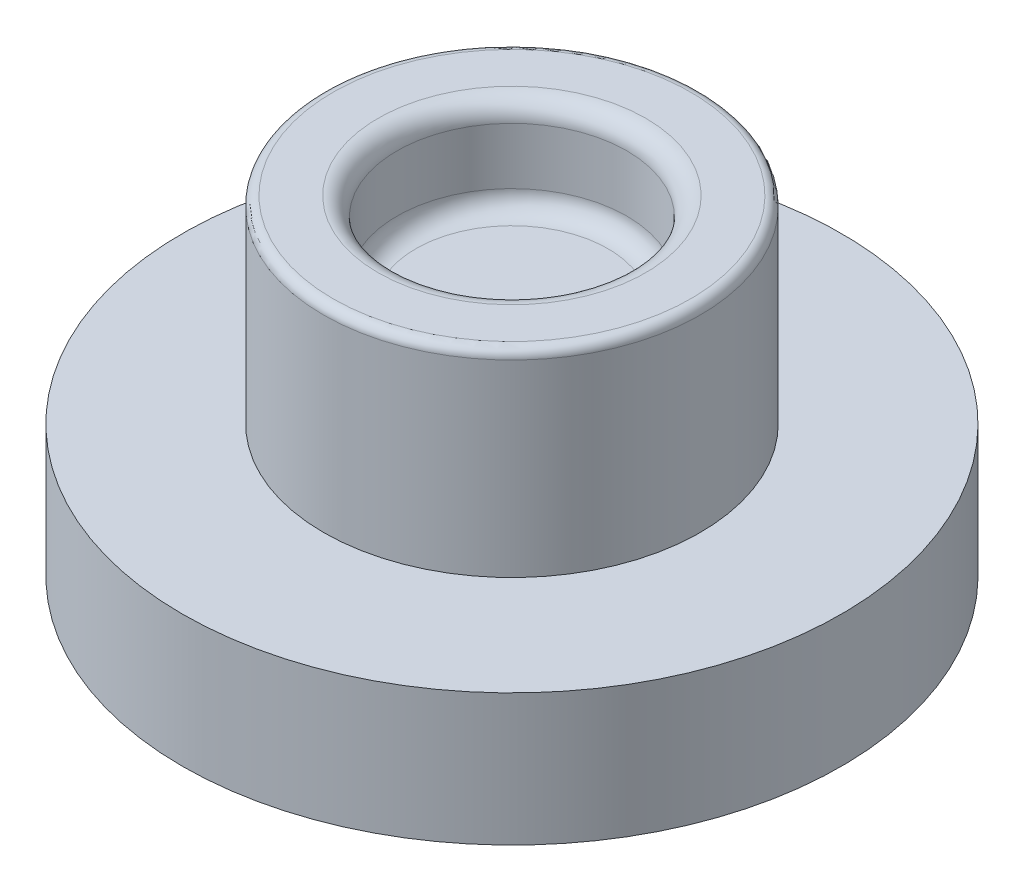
ISO-10303-21;
HEADER;
FILE_DESCRIPTION(('STEP AP214'),'2;1');
FILE_NAME('part.step','',(''),(''),'','','');
FILE_SCHEMA(('AUTOMOTIVE_DESIGN { 1 0 10303 214 1 1 1 1 }'));
ENDSEC;
DATA;
#1=APPLICATION_CONTEXT('core data for automotive mechanical design processes');
#2=APPLICATION_PROTOCOL_DEFINITION('international standard','automotive_design',2000,#1);
#3=PRODUCT_CONTEXT('',#1,'mechanical');
#4=PRODUCT('Part','Part','',(#3));
#5=PRODUCT_RELATED_PRODUCT_CATEGORY('part','',(#4));
#6=PRODUCT_DEFINITION_FORMATION('','',#4);
#7=PRODUCT_DEFINITION_CONTEXT('part definition',#1,'design');
#8=PRODUCT_DEFINITION('design','',#6,#7);
#9=PRODUCT_DEFINITION_SHAPE('','',#8);
#10=(LENGTH_UNIT() NAMED_UNIT(*) SI_UNIT(.MILLI.,.METRE.));
#11=(NAMED_UNIT(*) PLANE_ANGLE_UNIT() SI_UNIT($,.RADIAN.));
#12=(NAMED_UNIT(*) SI_UNIT($,.STERADIAN.) SOLID_ANGLE_UNIT());
#13=UNCERTAINTY_MEASURE_WITH_UNIT(LENGTH_MEASURE(1.E-05),#10,'distance_accuracy_value','');
#14=(GEOMETRIC_REPRESENTATION_CONTEXT(3) GLOBAL_UNCERTAINTY_ASSIGNED_CONTEXT((#13)) GLOBAL_UNIT_ASSIGNED_CONTEXT((#10,
#11,#12)) REPRESENTATION_CONTEXT('',''));
#15=CARTESIAN_POINT('',(0.,0.,0.));
#16=DIRECTION('',(0.,0.,1.));
#17=DIRECTION('',(1.,0.,0.));
#18=AXIS2_PLACEMENT_3D('',#15,#16,#17);
#19=CARTESIAN_POINT('',(0.,-1.4,0.));
#20=DIRECTION('',(0.,1.,0.));
#21=DIRECTION('',(0.,0.,1.));
#22=AXIS2_PLACEMENT_3D('',#19,#20,#21);
#23=CYLINDRICAL_SURFACE('',#22,3.5);
#24=CARTESIAN_POINT('',(0.,-1.4,0.));
#25=DIRECTION('',(0.,1.,0.));
#26=DIRECTION('',(0.,0.,1.));
#27=AXIS2_PLACEMENT_3D('',#24,#25,#26);
#28=CIRCLE('',#27,3.5);
#29=CARTESIAN_POINT('',(0.,-1.4,3.5));
#30=VERTEX_POINT('',#29);
#31=EDGE_CURVE('E62',#30,#30,#28,.T.);
#32=ORIENTED_EDGE('',*,*,#31,.T.);
#33=EDGE_LOOP('',(#32));
#34=FACE_BOUND('',#33,.T.);
#35=CARTESIAN_POINT('',(0.,0.,0.));
#36=DIRECTION('',(0.,1.,0.));
#37=DIRECTION('',(0.,0.,1.));
#38=AXIS2_PLACEMENT_3D('',#35,#36,#37);
#39=CIRCLE('',#38,3.5);
#40=CARTESIAN_POINT('',(0.,0.,3.5));
#41=VERTEX_POINT('',#40);
#42=EDGE_CURVE('E10',#41,#41,#39,.T.);
#43=ORIENTED_EDGE('',*,*,#42,.F.);
#44=EDGE_LOOP('',(#43));
#45=FACE_BOUND('',#44,.T.);
#46=ADVANCED_FACE('F31',(#34,#45),#23,.T.);
#47=CARTESIAN_POINT('',(2.,0.,0.));
#48=DIRECTION('',(0.,1.,0.));
#49=DIRECTION('',(0.,0.,1.));
#50=AXIS2_PLACEMENT_3D('',#47,#48,#49);
#51=PLANE('',#50);
#52=ORIENTED_EDGE('',*,*,#42,.T.);
#53=EDGE_LOOP('',(#52));
#54=FACE_BOUND('',#53,.T.);
#55=CARTESIAN_POINT('',(0.,0.,0.));
#56=DIRECTION('',(0.,1.,0.));
#57=DIRECTION('',(0.,0.,1.));
#58=AXIS2_PLACEMENT_3D('',#55,#56,#57);
#59=CIRCLE('',#58,2.);
#60=CARTESIAN_POINT('',(0.,0.,2.));
#61=VERTEX_POINT('',#60);
#62=EDGE_CURVE('E37',#61,#61,#59,.T.);
#63=ORIENTED_EDGE('',*,*,#62,.F.);
#64=EDGE_LOOP('',(#63));
#65=FACE_BOUND('',#64,.T.);
#66=ADVANCED_FACE('F79',(#54,#65),#51,.T.);
#67=CARTESIAN_POINT('',(0.,-1.4,0.));
#68=DIRECTION('',(0.,1.,0.));
#69=DIRECTION('',(0.,0.,1.));
#70=AXIS2_PLACEMENT_3D('',#67,#68,#69);
#71=CYLINDRICAL_SURFACE('',#70,2.);
#72=ORIENTED_EDGE('',*,*,#62,.T.);
#73=EDGE_LOOP('',(#72));
#74=FACE_BOUND('',#73,.T.);
#75=CARTESIAN_POINT('',(0.,2.,0.));
#76=DIRECTION('',(0.,1.,0.));
#77=DIRECTION('',(0.,0.,1.));
#78=AXIS2_PLACEMENT_3D('',#75,#76,#77);
#79=CIRCLE('',#78,2.);
#80=CARTESIAN_POINT('',(0.,2.,2.));
#81=VERTEX_POINT('',#80);
#82=EDGE_CURVE('E41',#81,#81,#79,.T.);
#83=ORIENTED_EDGE('',*,*,#82,.F.);
#84=EDGE_LOOP('',(#83));
#85=FACE_BOUND('',#84,.T.);
#86=ADVANCED_FACE('F83',(#74,#85),#71,.T.);
#87=CARTESIAN_POINT('',(0.,2.,0.));
#88=DIRECTION('',(0.,1.,0.));
#89=DIRECTION('',(0.,0.,1.));
#90=AXIS2_PLACEMENT_3D('',#87,#88,#89);
#91=TOROIDAL_SURFACE('',#90,1.9,0.1);
#92=ORIENTED_EDGE('',*,*,#82,.T.);
#93=EDGE_LOOP('',(#92));
#94=FACE_BOUND('',#93,.T.);
#95=CARTESIAN_POINT('',(0.,2.1,0.));
#96=DIRECTION('',(0.,1.,0.));
#97=DIRECTION('',(0.,0.,1.));
#98=AXIS2_PLACEMENT_3D('',#95,#96,#97);
#99=CIRCLE('',#98,1.90000000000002);
#100=CARTESIAN_POINT('',(0.,2.1,1.90000000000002));
#101=VERTEX_POINT('',#100);
#102=EDGE_CURVE('E45',#101,#101,#99,.T.);
#103=ORIENTED_EDGE('',*,*,#102,.F.);
#104=EDGE_LOOP('',(#103));
#105=FACE_BOUND('',#104,.T.);
#106=ADVANCED_FACE('F87',(#94,#105),#91,.T.);
#107=CARTESIAN_POINT('',(1.42119739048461,2.1,0.));
#108=DIRECTION('',(0.,1.,0.));
#109=DIRECTION('',(0.,0.,1.));
#110=AXIS2_PLACEMENT_3D('',#107,#108,#109);
#111=PLANE('',#110);
#112=ORIENTED_EDGE('',*,*,#102,.T.);
#113=EDGE_LOOP('',(#112));
#114=FACE_BOUND('',#113,.T.);
#115=CARTESIAN_POINT('',(0.,2.1,0.));
#116=DIRECTION('',(0.,1.,0.));
#117=DIRECTION('',(0.,0.,1.));
#118=AXIS2_PLACEMENT_3D('',#115,#116,#117);
#119=CIRCLE('',#118,1.42119739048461);
#120=CARTESIAN_POINT('',(0.,2.1,1.42119739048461));
#121=VERTEX_POINT('',#120);
#122=EDGE_CURVE('E50',#121,#121,#119,.T.);
#123=ORIENTED_EDGE('',*,*,#122,.F.);
#124=EDGE_LOOP('',(#123));
#125=FACE_BOUND('',#124,.T.);
#126=ADVANCED_FACE('F93',(#114,#125),#111,.T.);
#127=CARTESIAN_POINT('',(0.,1.9,0.));
#128=DIRECTION('',(0.,1.,0.));
#129=DIRECTION('',(0.,0.,1.));
#130=AXIS2_PLACEMENT_3D('',#127,#128,#129);
#131=TOROIDAL_SURFACE('',#130,1.42119739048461,0.2);
#132=ORIENTED_EDGE('',*,*,#122,.T.);
#133=EDGE_LOOP('',(#132));
#134=FACE_BOUND('',#133,.T.);
#135=CARTESIAN_POINT('',(0.,1.9,0.));
#136=DIRECTION('',(0.,1.,0.));
#137=DIRECTION('',(0.,0.,1.));
#138=AXIS2_PLACEMENT_3D('',#135,#136,#137);
#139=CIRCLE('',#138,1.22119739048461);
#140=CARTESIAN_POINT('',(0.,1.9,1.22119739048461));
#141=VERTEX_POINT('',#140);
#142=EDGE_CURVE('E53',#141,#141,#139,.T.);
#143=ORIENTED_EDGE('',*,*,#142,.F.);
#144=EDGE_LOOP('',(#143));
#145=FACE_BOUND('',#144,.T.);
#146=ADVANCED_FACE('F97',(#134,#145),#131,.T.);
#147=CARTESIAN_POINT('',(0.,-1.4,0.));
#148=DIRECTION('',(0.,1.,0.));
#149=DIRECTION('',(0.,0.,1.));
#150=AXIS2_PLACEMENT_3D('',#147,#148,#149);
#151=CYLINDRICAL_SURFACE('',#150,1.22119739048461);
#152=ORIENTED_EDGE('',*,*,#142,.T.);
#153=EDGE_LOOP('',(#152));
#154=FACE_BOUND('',#153,.T.);
#155=CARTESIAN_POINT('',(0.,1.3,0.));
#156=DIRECTION('',(0.,1.,0.));
#157=DIRECTION('',(0.,0.,1.));
#158=AXIS2_PLACEMENT_3D('',#155,#156,#157);
#159=CIRCLE('',#158,1.22119739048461);
#160=CARTESIAN_POINT('',(0.,1.3,1.22119739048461));
#161=VERTEX_POINT('',#160);
#162=EDGE_CURVE('E56',#161,#161,#159,.T.);
#163=ORIENTED_EDGE('',*,*,#162,.F.);
#164=EDGE_LOOP('',(#163));
#165=FACE_BOUND('',#164,.T.);
#166=ADVANCED_FACE('F101',(#154,#165),#151,.F.);
#167=CARTESIAN_POINT('',(0.,1.3,0.));
#168=DIRECTION('',(0.,1.,0.));
#169=DIRECTION('',(0.,0.,1.));
#170=AXIS2_PLACEMENT_3D('',#167,#168,#169);
#171=TOROIDAL_SURFACE('',#170,1.02119739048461,0.2);
#172=ORIENTED_EDGE('',*,*,#162,.T.);
#173=EDGE_LOOP('',(#172));
#174=FACE_BOUND('',#173,.T.);
#175=CARTESIAN_POINT('',(0.,1.1,0.));
#176=DIRECTION('',(0.,1.,0.));
#177=DIRECTION('',(0.,0.,1.));
#178=AXIS2_PLACEMENT_3D('',#175,#176,#177);
#179=CIRCLE('',#178,1.02119739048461);
#180=CARTESIAN_POINT('',(0.,1.1,1.02119739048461));
#181=VERTEX_POINT('',#180);
#182=EDGE_CURVE('E59',#181,#181,#179,.T.);
#183=ORIENTED_EDGE('',*,*,#182,.F.);
#184=EDGE_LOOP('',(#183));
#185=FACE_BOUND('',#184,.T.);
#186=ADVANCED_FACE('F75',(#174,#185),#171,.F.);
#187=CARTESIAN_POINT('',(0.,1.1,0.));
#188=DIRECTION('',(0.,1.,0.));
#189=DIRECTION('',(0.,0.,1.));
#190=AXIS2_PLACEMENT_3D('',#187,#188,#189);
#191=PLANE('',#190);
#192=ORIENTED_EDGE('',*,*,#182,.T.);
#193=EDGE_LOOP('',(#192));
#194=FACE_BOUND('',#193,.T.);
#195=ADVANCED_FACE('F70',(#194),#191,.T.);
#196=CARTESIAN_POINT('',(3.5,-1.4,0.));
#197=DIRECTION('',(0.,-1.,0.));
#198=DIRECTION('',(0.,0.,-1.));
#199=AXIS2_PLACEMENT_3D('',#196,#197,#198);
#200=PLANE('',#199);
#201=ORIENTED_EDGE('',*,*,#31,.F.);
#202=EDGE_LOOP('',(#201));
#203=FACE_BOUND('',#202,.T.);
#204=ADVANCED_FACE('F68',(#203),#200,.T.);
#205=CLOSED_SHELL('',(#46,#66,#86,#106,#126,#146,#166,#186,#195,#204));
#206=MANIFOLD_SOLID_BREP('B2',#205);
#207=ADVANCED_BREP_SHAPE_REPRESENTATION('',(#18,#206),#14);
#208=SHAPE_DEFINITION_REPRESENTATION(#9,#207);
ENDSEC;
END-ISO-10303-21;
